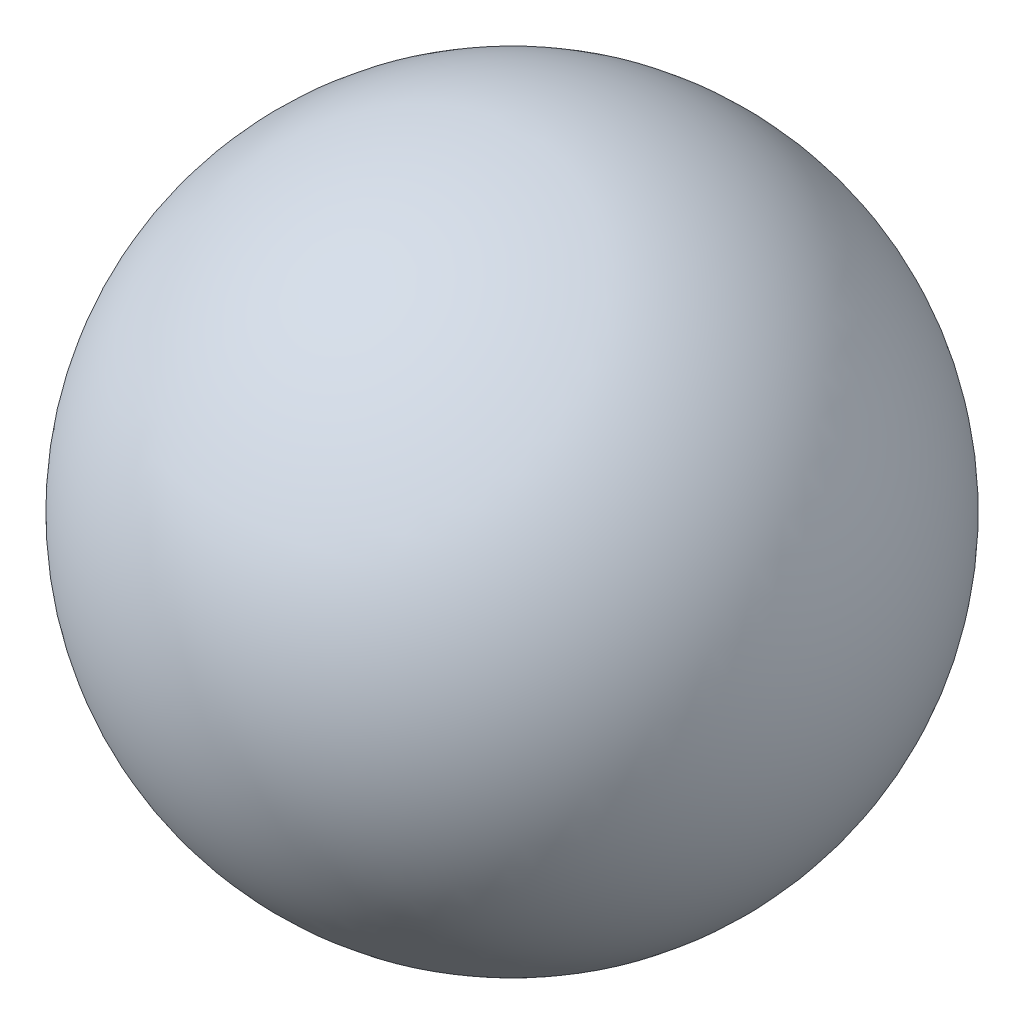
from build123d import *


with BuildPart() as part:
    # Esquisse1 → Base-R_volution (revolve)
    with BuildSketch(Plane.XY):
        with BuildLine():
            Line((0, 3.5), (0, -3.5))
            ThreePointArc((0, -3.5), (-3.5, 0), (0, 3.5))
        make_face()
    revolve(axis=Axis((0, 3.5, 0), (0, -1, 0)))


solid = part.part
